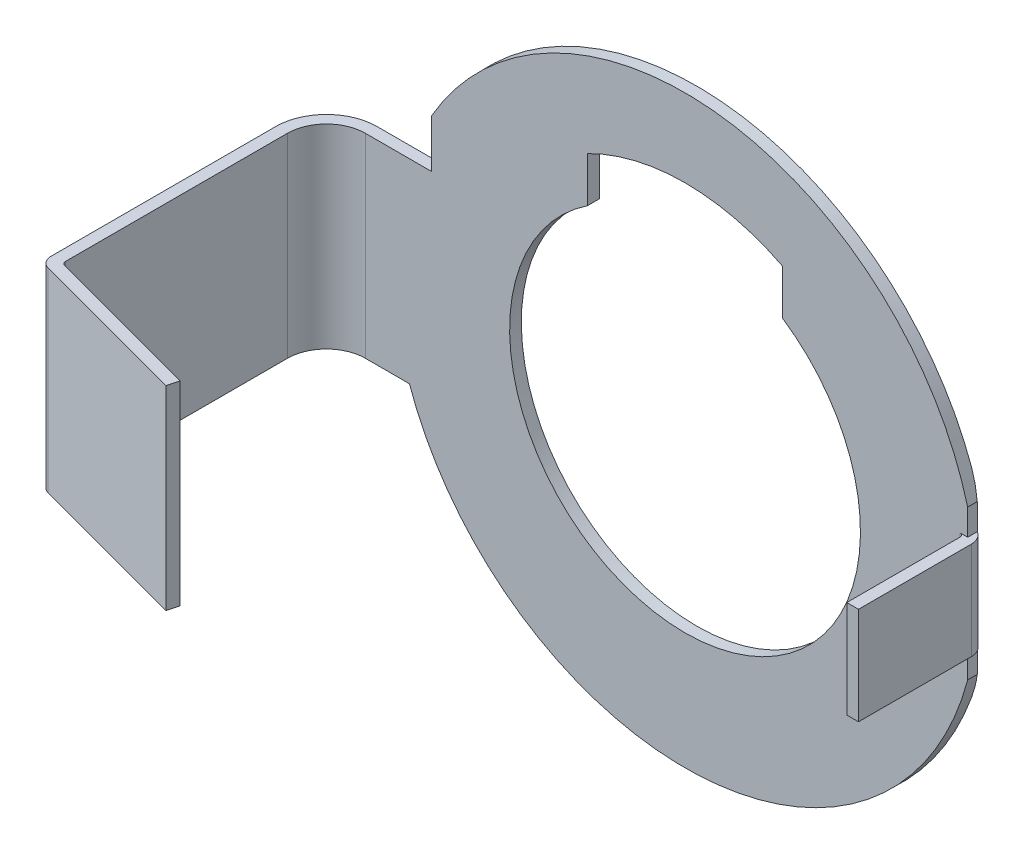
ISO-10303-21;
HEADER;
FILE_DESCRIPTION(('STEP AP214'),'2;1');
FILE_NAME('part.step','',(''),(''),'','','');
FILE_SCHEMA(('AUTOMOTIVE_DESIGN { 1 0 10303 214 1 1 1 1 }'));
ENDSEC;
DATA;
#1=APPLICATION_CONTEXT('core data for automotive mechanical design processes');
#2=APPLICATION_PROTOCOL_DEFINITION('international standard','automotive_design',2000,#1);
#3=PRODUCT_CONTEXT('',#1,'mechanical');
#4=PRODUCT('Part','Part','',(#3));
#5=PRODUCT_RELATED_PRODUCT_CATEGORY('part','',(#4));
#6=PRODUCT_DEFINITION_FORMATION('','',#4);
#7=PRODUCT_DEFINITION_CONTEXT('part definition',#1,'design');
#8=PRODUCT_DEFINITION('design','',#6,#7);
#9=PRODUCT_DEFINITION_SHAPE('','',#8);
#10=(LENGTH_UNIT() NAMED_UNIT(*) SI_UNIT(.MILLI.,.METRE.));
#11=(NAMED_UNIT(*) PLANE_ANGLE_UNIT() SI_UNIT($,.RADIAN.));
#12=(NAMED_UNIT(*) SI_UNIT($,.STERADIAN.) SOLID_ANGLE_UNIT());
#13=UNCERTAINTY_MEASURE_WITH_UNIT(LENGTH_MEASURE(1.E-05),#10,'distance_accuracy_value','');
#14=(GEOMETRIC_REPRESENTATION_CONTEXT(3) GLOBAL_UNCERTAINTY_ASSIGNED_CONTEXT((#13)) GLOBAL_UNIT_ASSIGNED_CONTEXT((#10,
#11,#12)) REPRESENTATION_CONTEXT('',''));
#15=CARTESIAN_POINT('',(0.,0.,0.));
#16=DIRECTION('',(0.,0.,1.));
#17=DIRECTION('',(1.,0.,0.));
#18=AXIS2_PLACEMENT_3D('',#15,#16,#17);
#19=CARTESIAN_POINT('',(7.25,10.,30.0723130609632));
#20=DIRECTION('',(1.,0.,0.));
#21=DIRECTION('',(0.,1.,0.));
#22=AXIS2_PLACEMENT_3D('',#19,#20,#21);
#23=PLANE('',#22);
#24=DIRECTION('',(0.,0.,1.));
#25=VECTOR('',#24,1.);
#26=CARTESIAN_POINT('',(7.25,1.25,30.0723130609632));
#27=LINE('',#26,#25);
#28=CARTESIAN_POINT('',(7.25,1.25,0.0535898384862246));
#29=VERTEX_POINT('',#28);
#30=CARTESIAN_POINT('',(7.25,1.25,0.3));
#31=VERTEX_POINT('',#30);
#32=EDGE_CURVE('E355',#29,#31,#27,.T.);
#33=ORIENTED_EDGE('',*,*,#32,.F.);
#34=DIRECTION('',(0.,1.,0.));
#35=VECTOR('',#34,1.);
#36=CARTESIAN_POINT('',(7.25,1.25,0.0535898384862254));
#37=LINE('',#36,#35);
#38=CARTESIAN_POINT('',(7.25,1.92028643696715,0.053589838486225));
#39=VERTEX_POINT('',#38);
#40=EDGE_CURVE('E362',#29,#39,#37,.T.);
#41=ORIENTED_EDGE('',*,*,#40,.T.);
#42=DIRECTION('',(0.,0.,-1.));
#43=VECTOR('',#42,1.);
#44=CARTESIAN_POINT('',(7.25,1.92028643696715,0.3));
#45=LINE('',#44,#43);
#46=CARTESIAN_POINT('',(7.25,1.92028643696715,0.3));
#47=VERTEX_POINT('',#46);
#48=EDGE_CURVE('E347',#39,#47,#45,.F.);
#49=ORIENTED_EDGE('',*,*,#48,.T.);
#50=DIRECTION('',(0.,1.,0.));
#51=VECTOR('',#50,1.);
#52=CARTESIAN_POINT('',(7.25,0.,0.3));
#53=LINE('',#52,#51);
#54=EDGE_CURVE('E266',#31,#47,#53,.T.);
#55=ORIENTED_EDGE('',*,*,#54,.F.);
#56=EDGE_LOOP('',(#33,#41,#49,#55));
#57=FACE_BOUND('',#56,.T.);
#58=ADVANCED_FACE('F29',(#57),#23,.T.);
#59=CARTESIAN_POINT('',(0.,0.,0.3));
#60=DIRECTION('',(0.,0.,1.));
#61=DIRECTION('',(1.,0.,0.));
#62=AXIS2_PLACEMENT_3D('',#59,#60,#61);
#63=PLANE('',#62);
#64=DIRECTION('',(1.,0.,0.));
#65=VECTOR('',#64,1.);
#66=CARTESIAN_POINT('',(0.,-1.25,0.3));
#67=LINE('',#66,#65);
#68=CARTESIAN_POINT('',(7.05,-1.25,0.3));
#69=VERTEX_POINT('',#68);
#70=CARTESIAN_POINT('',(7.25,-1.25,0.3));
#71=VERTEX_POINT('',#70);
#72=EDGE_CURVE('E261',#69,#71,#67,.T.);
#73=ORIENTED_EDGE('',*,*,#72,.F.);
#74=DIRECTION('',(0.,-1.,0.));
#75=VECTOR('',#74,1.);
#76=CARTESIAN_POINT('',(7.05,1.25,0.3));
#77=LINE('',#76,#75);
#78=CARTESIAN_POINT('',(7.05,1.25,0.3));
#79=VERTEX_POINT('',#78);
#80=EDGE_CURVE('E399',#69,#79,#77,.F.);
#81=ORIENTED_EDGE('',*,*,#80,.T.);
#82=DIRECTION('',(-1.,0.,0.));
#83=VECTOR('',#82,1.);
#84=CARTESIAN_POINT('',(0.,1.25,0.3));
#85=LINE('',#84,#83);
#86=EDGE_CURVE('E264',#31,#79,#85,.T.);
#87=ORIENTED_EDGE('',*,*,#86,.F.);
#88=ORIENTED_EDGE('',*,*,#54,.T.);
#89=CARTESIAN_POINT('',(0.,0.,0.3));
#90=DIRECTION('',(0.,0.,1.));
#91=DIRECTION('',(1.,0.,0.));
#92=AXIS2_PLACEMENT_3D('',#89,#90,#91);
#93=CIRCLE('',#92,7.5);
#94=CARTESIAN_POINT('',(-6.5,3.74165738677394,0.3));
#95=VERTEX_POINT('',#94);
#96=EDGE_CURVE('E322',#47,#95,#93,.T.);
#97=ORIENTED_EDGE('',*,*,#96,.T.);
#98=DIRECTION('',(0.,-1.,0.));
#99=VECTOR('',#98,1.);
#100=CARTESIAN_POINT('',(-6.5,3.74165738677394,0.3));
#101=LINE('',#100,#99);
#102=CARTESIAN_POINT('',(-6.5,2.5,0.3));
#103=VERTEX_POINT('',#102);
#104=EDGE_CURVE('E420',#95,#103,#101,.T.);
#105=ORIENTED_EDGE('',*,*,#104,.T.);
#106=DIRECTION('',(-1.,0.,0.));
#107=VECTOR('',#106,1.);
#108=CARTESIAN_POINT('',(-9.5,2.5,0.3));
#109=LINE('',#108,#107);
#110=CARTESIAN_POINT('',(-8.2,2.5,0.3));
#111=VERTEX_POINT('',#110);
#112=EDGE_CURVE('E415',#103,#111,#109,.T.);
#113=ORIENTED_EDGE('',*,*,#112,.T.);
#114=DIRECTION('',(0.,-1.,0.));
#115=VECTOR('',#114,1.);
#116=CARTESIAN_POINT('',(-8.2,-2.5,0.3));
#117=LINE('',#116,#115);
#118=CARTESIAN_POINT('',(-8.2,-2.5,0.3));
#119=VERTEX_POINT('',#118);
#120=EDGE_CURVE('E325',#111,#119,#117,.T.);
#121=ORIENTED_EDGE('',*,*,#120,.T.);
#122=DIRECTION('',(1.,0.,0.));
#123=VECTOR('',#122,1.);
#124=CARTESIAN_POINT('',(-9.5,-2.5,0.3));
#125=LINE('',#124,#123);
#126=CARTESIAN_POINT('',(-7.07106781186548,-2.5,0.3));
#127=VERTEX_POINT('',#126);
#128=EDGE_CURVE('E314',#119,#127,#125,.T.);
#129=ORIENTED_EDGE('',*,*,#128,.T.);
#130=CARTESIAN_POINT('',(7.25,-1.92028643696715,0.3));
#131=VERTEX_POINT('',#130);
#132=EDGE_CURVE('E317',#127,#131,#93,.T.);
#133=ORIENTED_EDGE('',*,*,#132,.T.);
#134=EDGE_CURVE('E267',#131,#71,#53,.T.);
#135=ORIENTED_EDGE('',*,*,#134,.T.);
#136=EDGE_LOOP('',(#73,#81,#87,#88,#97,#105,#113,#121,#129,#133,#135));
#137=FACE_BOUND('',#136,.T.);
#138=DIRECTION('',(0.,-1.,0.));
#139=VECTOR('',#138,1.);
#140=CARTESIAN_POINT('',(-2.5,4.89897948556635,0.3));
#141=LINE('',#140,#139);
#142=CARTESIAN_POINT('',(-2.5,4.89897948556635,0.3));
#143=VERTEX_POINT('',#142);
#144=CARTESIAN_POINT('',(-2.5,3.74165738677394,0.3));
#145=VERTEX_POINT('',#144);
#146=EDGE_CURVE('E286',#143,#145,#141,.T.);
#147=ORIENTED_EDGE('',*,*,#146,.F.);
#148=CARTESIAN_POINT('',(0.,0.,0.3));
#149=DIRECTION('',(0.,0.,1.));
#150=DIRECTION('',(1.,0.,0.));
#151=AXIS2_PLACEMENT_3D('',#148,#149,#150);
#152=CIRCLE('',#151,5.5);
#153=CARTESIAN_POINT('',(2.5,4.89897948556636,0.3));
#154=VERTEX_POINT('',#153);
#155=EDGE_CURVE('E284',#154,#143,#152,.T.);
#156=ORIENTED_EDGE('',*,*,#155,.F.);
#157=DIRECTION('',(0.,1.,0.));
#158=VECTOR('',#157,1.);
#159=CARTESIAN_POINT('',(2.5,4.89897948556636,0.3));
#160=LINE('',#159,#158);
#161=CARTESIAN_POINT('',(2.5,3.74165738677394,0.3));
#162=VERTEX_POINT('',#161);
#163=EDGE_CURVE('E291',#162,#154,#160,.T.);
#164=ORIENTED_EDGE('',*,*,#163,.F.);
#165=CARTESIAN_POINT('',(0.,0.,0.3));
#166=DIRECTION('',(0.,0.,1.));
#167=DIRECTION('',(1.,0.,0.));
#168=AXIS2_PLACEMENT_3D('',#165,#166,#167);
#169=CIRCLE('',#168,4.5);
#170=EDGE_CURVE('E288',#145,#162,#169,.T.);
#171=ORIENTED_EDGE('',*,*,#170,.F.);
#172=EDGE_LOOP('',(#147,#156,#164,#171));
#173=FACE_BOUND('',#172,.T.);
#174=ADVANCED_FACE('F458',(#137,#173),#63,.T.);
#175=CARTESIAN_POINT('',(0.,0.,0.));
#176=DIRECTION('',(0.,0.,1.));
#177=DIRECTION('',(1.,0.,0.));
#178=AXIS2_PLACEMENT_3D('',#175,#176,#177);
#179=PLANE('',#178);
#180=CARTESIAN_POINT('',(0.,0.,0.));
#181=DIRECTION('',(0.,0.,1.));
#182=DIRECTION('',(1.,0.,0.));
#183=AXIS2_PLACEMENT_3D('',#180,#181,#182);
#184=CIRCLE('',#183,5.5);
#185=CARTESIAN_POINT('',(2.5,4.89897948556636,0.));
#186=VERTEX_POINT('',#185);
#187=CARTESIAN_POINT('',(-2.5,4.89897948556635,0.));
#188=VERTEX_POINT('',#187);
#189=EDGE_CURVE('E271',#186,#188,#184,.T.);
#190=ORIENTED_EDGE('',*,*,#189,.T.);
#191=DIRECTION('',(0.,-1.,0.));
#192=VECTOR('',#191,1.);
#193=CARTESIAN_POINT('',(-2.5,4.89897948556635,0.));
#194=LINE('',#193,#192);
#195=CARTESIAN_POINT('',(-2.5,3.74165738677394,0.));
#196=VERTEX_POINT('',#195);
#197=EDGE_CURVE('E274',#188,#196,#194,.T.);
#198=ORIENTED_EDGE('',*,*,#197,.T.);
#199=CARTESIAN_POINT('',(0.,0.,0.));
#200=DIRECTION('',(0.,0.,1.));
#201=DIRECTION('',(1.,0.,0.));
#202=AXIS2_PLACEMENT_3D('',#199,#200,#201);
#203=CIRCLE('',#202,4.5);
#204=CARTESIAN_POINT('',(2.5,3.74165738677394,0.));
#205=VERTEX_POINT('',#204);
#206=EDGE_CURVE('E278',#196,#205,#203,.T.);
#207=ORIENTED_EDGE('',*,*,#206,.T.);
#208=DIRECTION('',(0.,1.,0.));
#209=VECTOR('',#208,1.);
#210=CARTESIAN_POINT('',(2.5,4.89897948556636,0.));
#211=LINE('',#210,#209);
#212=EDGE_CURVE('E281',#205,#186,#211,.T.);
#213=ORIENTED_EDGE('',*,*,#212,.T.);
#214=EDGE_LOOP('',(#190,#198,#207,#213));
#215=FACE_BOUND('',#214,.T.);
#216=CARTESIAN_POINT('',(0.,0.,0.));
#217=DIRECTION('',(0.,0.,1.));
#218=DIRECTION('',(1.,0.,0.));
#219=AXIS2_PLACEMENT_3D('',#216,#217,#218);
#220=CIRCLE('',#219,7.5);
#221=CARTESIAN_POINT('',(7.05,2.5588083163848,0.));
#222=VERTEX_POINT('',#221);
#223=CARTESIAN_POINT('',(-6.5,3.74165738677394,0.));
#224=VERTEX_POINT('',#223);
#225=EDGE_CURVE('E305',#222,#224,#220,.T.);
#226=ORIENTED_EDGE('',*,*,#225,.F.);
#227=DIRECTION('',(0.,1.,0.));
#228=VECTOR('',#227,1.);
#229=CARTESIAN_POINT('',(7.05,0.,0.));
#230=LINE('',#229,#228);
#231=CARTESIAN_POINT('',(7.05,-2.5588083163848,0.));
#232=VERTEX_POINT('',#231);
#233=EDGE_CURVE('E371',#222,#232,#230,.F.);
#234=ORIENTED_EDGE('',*,*,#233,.T.);
#235=CARTESIAN_POINT('',(-7.07106781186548,-2.5,0.));
#236=VERTEX_POINT('',#235);
#237=EDGE_CURVE('E306',#236,#232,#220,.T.);
#238=ORIENTED_EDGE('',*,*,#237,.F.);
#239=DIRECTION('',(1.,0.,0.));
#240=VECTOR('',#239,1.);
#241=CARTESIAN_POINT('',(-9.5,-2.5,0.));
#242=LINE('',#241,#240);
#243=CARTESIAN_POINT('',(-8.2,-2.5,0.));
#244=VERTEX_POINT('',#243);
#245=EDGE_CURVE('E303',#244,#236,#242,.T.);
#246=ORIENTED_EDGE('',*,*,#245,.F.);
#247=DIRECTION('',(0.,-1.,0.));
#248=VECTOR('',#247,1.);
#249=CARTESIAN_POINT('',(-8.2,0.,0.));
#250=LINE('',#249,#248);
#251=CARTESIAN_POINT('',(-8.2,2.5,0.));
#252=VERTEX_POINT('',#251);
#253=EDGE_CURVE('E342',#244,#252,#250,.F.);
#254=ORIENTED_EDGE('',*,*,#253,.T.);
#255=DIRECTION('',(-1.,0.,0.));
#256=VECTOR('',#255,1.);
#257=CARTESIAN_POINT('',(-9.5,2.5,0.));
#258=LINE('',#257,#256);
#259=CARTESIAN_POINT('',(-6.5,2.5,0.));
#260=VERTEX_POINT('',#259);
#261=EDGE_CURVE('E311',#260,#252,#258,.T.);
#262=ORIENTED_EDGE('',*,*,#261,.F.);
#263=DIRECTION('',(0.,-1.,0.));
#264=VECTOR('',#263,1.);
#265=CARTESIAN_POINT('',(-6.5,3.74165738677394,0.));
#266=LINE('',#265,#264);
#267=EDGE_CURVE('E309',#224,#260,#266,.T.);
#268=ORIENTED_EDGE('',*,*,#267,.F.);
#269=EDGE_LOOP('',(#226,#234,#238,#246,#254,#262,#268));
#270=FACE_BOUND('',#269,.T.);
#271=ADVANCED_FACE('F382',(#215,#270),#179,.F.);
#272=CARTESIAN_POINT('',(0.,0.,0.3));
#273=DIRECTION('',(0.,0.,-1.));
#274=DIRECTION('',(-1.,0.,0.));
#275=AXIS2_PLACEMENT_3D('',#272,#273,#274);
#276=CYLINDRICAL_SURFACE('',#275,7.5);
#277=ORIENTED_EDGE('',*,*,#237,.T.);
#278=CARTESIAN_POINT('',(7.05,-2.5588083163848,0.));
#279=CARTESIAN_POINT('',(7.06913024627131,-2.50610443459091,2.0071498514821E-05));
#280=CARTESIAN_POINT('',(7.08766163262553,-2.45320068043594,0.00137069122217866));
#281=CARTESIAN_POINT('',(7.1234716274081,-2.34718383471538,0.00638604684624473));
#282=CARTESIAN_POINT('',(7.14075243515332,-2.29407129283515,0.0100466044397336));
#283=CARTESIAN_POINT('',(7.17407392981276,-2.18764111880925,0.0193369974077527));
#284=CARTESIAN_POINT('',(7.19011472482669,-2.13432350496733,0.0249666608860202));
#285=CARTESIAN_POINT('',(7.22098066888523,-2.0274464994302,0.0379989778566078));
#286=CARTESIAN_POINT('',(7.23580357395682,-1.9738868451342,0.0454048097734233));
#287=CARTESIAN_POINT('',(7.25,-1.92028643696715,0.053589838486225));
#288=B_SPLINE_CURVE_WITH_KNOTS('',3,(#278,#279,#280,#281,#282,#283,#284,#285,#286,#287),
.UNSPECIFIED.,.F.,.F.,(4,2,2,2,4),(0.,0.168162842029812,0.336022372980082,0.503867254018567,
0.672014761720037),.UNSPECIFIED.);
#289=CARTESIAN_POINT('',(7.25,-1.92028643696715,0.053589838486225));
#290=VERTEX_POINT('',#289);
#291=EDGE_CURVE('E387',#232,#290,#288,.T.);
#292=ORIENTED_EDGE('',*,*,#291,.T.);
#293=DIRECTION('',(0.,0.,-1.));
#294=VECTOR('',#293,1.);
#295=CARTESIAN_POINT('',(7.25,-1.92028643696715,0.3));
#296=LINE('',#295,#294);
#297=EDGE_CURVE('E349',#131,#290,#296,.T.);
#298=ORIENTED_EDGE('',*,*,#297,.F.);
#299=ORIENTED_EDGE('',*,*,#132,.F.);
#300=DIRECTION('',(0.,0.,-1.));
#301=VECTOR('',#300,1.);
#302=CARTESIAN_POINT('',(-7.07106781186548,-2.5,0.3));
#303=LINE('',#302,#301);
#304=EDGE_CURVE('E430',#127,#236,#303,.T.);
#305=ORIENTED_EDGE('',*,*,#304,.T.);
#306=EDGE_LOOP('',(#277,#292,#298,#299,#305));
#307=FACE_BOUND('',#306,.T.);
#308=ADVANCED_FACE('F377',(#307),#276,.T.);
#309=ORIENTED_EDGE('',*,*,#48,.F.);
#310=CARTESIAN_POINT('',(7.25,1.92028643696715,0.053589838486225));
#311=CARTESIAN_POINT('',(7.23580357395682,1.9738868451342,0.045404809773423));
#312=CARTESIAN_POINT('',(7.22098066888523,2.0274464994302,0.0379989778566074));
#313=CARTESIAN_POINT('',(7.19011472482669,2.13432350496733,0.02496666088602));
#314=CARTESIAN_POINT('',(7.17407392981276,2.18764111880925,0.0193369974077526));
#315=CARTESIAN_POINT('',(7.14075243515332,2.29407129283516,0.0100466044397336));
#316=CARTESIAN_POINT('',(7.1234716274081,2.34718383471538,0.00638604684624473));
#317=CARTESIAN_POINT('',(7.08766163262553,2.45320068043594,0.00137069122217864));
#318=CARTESIAN_POINT('',(7.06913024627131,2.50610443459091,2.00714985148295E-05));
#319=CARTESIAN_POINT('',(7.05,2.5588083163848,0.));
#320=B_SPLINE_CURVE_WITH_KNOTS('',3,(#310,#311,#312,#313,#314,#315,#316,#317,#318,#319),
.UNSPECIFIED.,.F.,.F.,(4,2,2,2,4),(0.,0.16814750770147,0.335992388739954,0.503851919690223,
0.672014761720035),.UNSPECIFIED.);
#321=EDGE_CURVE('E364',#39,#222,#320,.T.);
#322=ORIENTED_EDGE('',*,*,#321,.T.);
#323=ORIENTED_EDGE('',*,*,#225,.T.);
#324=DIRECTION('',(0.,0.,-1.));
#325=VECTOR('',#324,1.);
#326=CARTESIAN_POINT('',(-6.5,3.74165738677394,0.3));
#327=LINE('',#326,#325);
#328=EDGE_CURVE('E428',#95,#224,#327,.T.);
#329=ORIENTED_EDGE('',*,*,#328,.F.);
#330=ORIENTED_EDGE('',*,*,#96,.F.);
#331=EDGE_LOOP('',(#309,#322,#323,#329,#330));
#332=FACE_BOUND('',#331,.T.);
#333=ADVANCED_FACE('F381',(#332),#276,.T.);
#334=CARTESIAN_POINT('',(-9.5,2.5,0.3));
#335=DIRECTION('',(1.,0.,0.));
#336=DIRECTION('',(0.,0.,-1.));
#337=AXIS2_PLACEMENT_3D('',#334,#335,#336);
#338=PLANE('',#337);
#339=DIRECTION('',(0.,0.,-1.));
#340=VECTOR('',#339,1.);
#341=CARTESIAN_POINT('',(-9.5,-2.5,0.3));
#342=LINE('',#341,#340);
#343=CARTESIAN_POINT('',(-9.5,-2.5,7.06980190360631));
#344=VERTEX_POINT('',#343);
#345=CARTESIAN_POINT('',(-9.5,-2.5,1.3));
#346=VERTEX_POINT('',#345);
#347=EDGE_CURVE('E329',#344,#346,#342,.T.);
#348=ORIENTED_EDGE('',*,*,#347,.F.);
#349=DIRECTION('',(0.,-1.,0.));
#350=VECTOR('',#349,1.);
#351=CARTESIAN_POINT('',(-9.5,2.5,7.06980190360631));
#352=LINE('',#351,#350);
#353=CARTESIAN_POINT('',(-9.5,2.5,7.06980190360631));
#354=VERTEX_POINT('',#353);
#355=EDGE_CURVE('E37',#344,#354,#352,.F.);
#356=ORIENTED_EDGE('',*,*,#355,.T.);
#357=DIRECTION('',(0.,0.,-1.));
#358=VECTOR('',#357,1.);
#359=CARTESIAN_POINT('',(-9.5,2.5,0.3));
#360=LINE('',#359,#358);
#361=CARTESIAN_POINT('',(-9.5,2.5,1.3));
#362=VERTEX_POINT('',#361);
#363=EDGE_CURVE('E419',#354,#362,#360,.T.);
#364=ORIENTED_EDGE('',*,*,#363,.T.);
#365=DIRECTION('',(0.,-1.,0.));
#366=VECTOR('',#365,1.);
#367=CARTESIAN_POINT('',(-9.5,2.5,1.3));
#368=LINE('',#367,#366);
#369=EDGE_CURVE('E337',#362,#346,#368,.T.);
#370=ORIENTED_EDGE('',*,*,#369,.T.);
#371=EDGE_LOOP('',(#348,#356,#364,#370));
#372=FACE_BOUND('',#371,.T.);
#373=ADVANCED_FACE('F31',(#372),#338,.F.);
#374=CARTESIAN_POINT('',(-9.5,-2.5,0.3));
#375=DIRECTION('',(0.,1.,0.));
#376=DIRECTION('',(-1.,0.,0.));
#377=AXIS2_PLACEMENT_3D('',#374,#375,#376);
#378=PLANE('',#377);
#379=DIRECTION('',(0.965925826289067,0.,0.258819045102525));
#380=VECTOR('',#379,1.);
#381=CARTESIAN_POINT('',(-9.5,-2.5,7.3));
#382=LINE('',#381,#380);
#383=CARTESIAN_POINT('',(-9.27764571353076,-2.5,7.35957965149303));
#384=VERTEX_POINT('',#383);
#385=CARTESIAN_POINT('',(-5.1533337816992,-2.5,8.46468570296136));
#386=VERTEX_POINT('',#385);
#387=EDGE_CURVE('E206',#384,#386,#382,.T.);
#388=ORIENTED_EDGE('',*,*,#387,.F.);
#389=CARTESIAN_POINT('',(-9.2,-2.5,7.06980190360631));
#390=DIRECTION('',(0.,1.,0.));
#391=DIRECTION('',(-1.,0.,0.));
#392=AXIS2_PLACEMENT_3D('',#389,#390,#391);
#393=CIRCLE('',#392,0.3);
#394=EDGE_CURVE('E51',#384,#344,#393,.F.);
#395=ORIENTED_EDGE('',*,*,#394,.T.);
#396=ORIENTED_EDGE('',*,*,#347,.T.);
#397=CARTESIAN_POINT('',(-8.2,-2.5,1.3));
#398=DIRECTION('',(0.,1.,0.));
#399=DIRECTION('',(-1.,0.,0.));
#400=AXIS2_PLACEMENT_3D('',#397,#398,#399);
#401=CIRCLE('',#400,1.3);
#402=EDGE_CURVE('E340',#346,#244,#401,.F.);
#403=ORIENTED_EDGE('',*,*,#402,.T.);
#404=ORIENTED_EDGE('',*,*,#245,.T.);
#405=ORIENTED_EDGE('',*,*,#304,.F.);
#406=ORIENTED_EDGE('',*,*,#128,.F.);
#407=CARTESIAN_POINT('',(-8.2,-2.5,1.3));
#408=DIRECTION('',(0.,1.,0.));
#409=DIRECTION('',(-1.,0.,0.));
#410=AXIS2_PLACEMENT_3D('',#407,#408,#409);
#411=CIRCLE('',#410,1.);
#412=CARTESIAN_POINT('',(-9.2,-2.5,1.3));
#413=VERTEX_POINT('',#412);
#414=EDGE_CURVE('E332',#119,#413,#411,.T.);
#415=ORIENTED_EDGE('',*,*,#414,.T.);
#416=DIRECTION('',(0.,0.,-1.));
#417=VECTOR('',#416,1.);
#418=CARTESIAN_POINT('',(-9.2,-2.5,7.3));
#419=LINE('',#418,#417);
#420=CARTESIAN_POINT('',(-9.2,-2.5,6.99306920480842));
#421=VERTEX_POINT('',#420);
#422=EDGE_CURVE('E275',#421,#413,#419,.T.);
#423=ORIENTED_EDGE('',*,*,#422,.F.);
#424=CARTESIAN_POINT('',(-9.1,-2.5,6.99306920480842));
#425=DIRECTION('',(0.,1.,0.));
#426=DIRECTION('',(-1.,0.,0.));
#427=AXIS2_PLACEMENT_3D('',#424,#425,#426);
#428=CIRCLE('',#427,0.1);
#429=CARTESIAN_POINT('',(-9.12588190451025,-2.5,7.08966178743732));
#430=VERTEX_POINT('',#429);
#431=EDGE_CURVE('E473',#421,#430,#428,.T.);
#432=ORIENTED_EDGE('',*,*,#431,.T.);
#433=DIRECTION('',(0.965925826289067,0.,0.258819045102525));
#434=VECTOR('',#433,1.);
#435=CARTESIAN_POINT('',(-9.42235428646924,-2.5,7.01022225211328));
#436=LINE('',#435,#434);
#437=CARTESIAN_POINT('',(-5.07568806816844,-2.5,8.17490795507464));
#438=VERTEX_POINT('',#437);
#439=EDGE_CURVE('E228',#430,#438,#436,.T.);
#440=ORIENTED_EDGE('',*,*,#439,.T.);
#441=DIRECTION('',(-0.258819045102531,0.,0.965925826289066));
#442=VECTOR('',#441,1.);
#443=CARTESIAN_POINT('',(-5.07568806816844,-2.5,8.17490795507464));
#444=LINE('',#443,#442);
#445=EDGE_CURVE('E215',#438,#386,#444,.T.);
#446=ORIENTED_EDGE('',*,*,#445,.T.);
#447=EDGE_LOOP('',(#388,#395,#396,#403,#404,#405,#406,#415,#423,#432,#440,#446));
#448=FACE_BOUND('',#447,.T.);
#449=ADVANCED_FACE('F226',(#448),#378,.F.);
#450=CARTESIAN_POINT('',(-6.5,3.74165738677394,0.3));
#451=DIRECTION('',(1.,0.,0.));
#452=DIRECTION('',(0.,1.,0.));
#453=AXIS2_PLACEMENT_3D('',#450,#451,#452);
#454=PLANE('',#453);
#455=ORIENTED_EDGE('',*,*,#267,.T.);
#456=DIRECTION('',(0.,0.,-1.));
#457=VECTOR('',#456,1.);
#458=CARTESIAN_POINT('',(-6.5,2.5,0.3));
#459=LINE('',#458,#457);
#460=EDGE_CURVE('E425',#103,#260,#459,.T.);
#461=ORIENTED_EDGE('',*,*,#460,.F.);
#462=ORIENTED_EDGE('',*,*,#104,.F.);
#463=ORIENTED_EDGE('',*,*,#328,.T.);
#464=EDGE_LOOP('',(#455,#461,#462,#463));
#465=FACE_BOUND('',#464,.T.);
#466=ADVANCED_FACE('F384',(#465),#454,.F.);
#467=CARTESIAN_POINT('',(-9.5,2.5,0.3));
#468=DIRECTION('',(0.,-1.,0.));
#469=DIRECTION('',(1.,0.,0.));
#470=AXIS2_PLACEMENT_3D('',#467,#468,#469);
#471=PLANE('',#470);
#472=ORIENTED_EDGE('',*,*,#363,.F.);
#473=CARTESIAN_POINT('',(-9.2,2.5,7.06980190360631));
#474=DIRECTION('',(0.,-1.,0.));
#475=DIRECTION('',(1.,0.,0.));
#476=AXIS2_PLACEMENT_3D('',#473,#474,#475);
#477=CIRCLE('',#476,0.3);
#478=CARTESIAN_POINT('',(-9.27764571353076,2.5,7.35957965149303));
#479=VERTEX_POINT('',#478);
#480=EDGE_CURVE('E11',#354,#479,#477,.F.);
#481=ORIENTED_EDGE('',*,*,#480,.T.);
#482=DIRECTION('',(0.965925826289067,0.,0.258819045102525));
#483=VECTOR('',#482,1.);
#484=CARTESIAN_POINT('',(-9.5,2.5,7.3));
#485=LINE('',#484,#483);
#486=CARTESIAN_POINT('',(-5.1533337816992,2.5,8.46468570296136));
#487=VERTEX_POINT('',#486);
#488=EDGE_CURVE('E231',#479,#487,#485,.T.);
#489=ORIENTED_EDGE('',*,*,#488,.T.);
#490=DIRECTION('',(-0.258819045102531,0.,0.965925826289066));
#491=VECTOR('',#490,1.);
#492=CARTESIAN_POINT('',(-5.07568806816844,2.5,8.17490795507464));
#493=LINE('',#492,#491);
#494=CARTESIAN_POINT('',(-5.07568806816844,2.5,8.17490795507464));
#495=VERTEX_POINT('',#494);
#496=EDGE_CURVE('E222',#495,#487,#493,.T.);
#497=ORIENTED_EDGE('',*,*,#496,.F.);
#498=DIRECTION('',(0.965925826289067,0.,0.258819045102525));
#499=VECTOR('',#498,1.);
#500=CARTESIAN_POINT('',(-9.42235428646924,2.5,7.01022225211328));
#501=LINE('',#500,#499);
#502=CARTESIAN_POINT('',(-9.12588190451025,2.5,7.08966178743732));
#503=VERTEX_POINT('',#502);
#504=EDGE_CURVE('E236',#503,#495,#501,.T.);
#505=ORIENTED_EDGE('',*,*,#504,.F.);
#506=CARTESIAN_POINT('',(-9.1,2.5,6.99306920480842));
#507=DIRECTION('',(0.,-1.,0.));
#508=DIRECTION('',(1.,0.,0.));
#509=AXIS2_PLACEMENT_3D('',#506,#507,#508);
#510=CIRCLE('',#509,0.1);
#511=CARTESIAN_POINT('',(-9.2,2.5,6.99306920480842));
#512=VERTEX_POINT('',#511);
#513=EDGE_CURVE('E479',#503,#512,#510,.T.);
#514=ORIENTED_EDGE('',*,*,#513,.T.);
#515=DIRECTION('',(0.,0.,-1.));
#516=VECTOR('',#515,1.);
#517=CARTESIAN_POINT('',(-9.2,2.5,7.3));
#518=LINE('',#517,#516);
#519=CARTESIAN_POINT('',(-9.2,2.5,1.3));
#520=VERTEX_POINT('',#519);
#521=EDGE_CURVE('E270',#512,#520,#518,.T.);
#522=ORIENTED_EDGE('',*,*,#521,.T.);
#523=CARTESIAN_POINT('',(-8.2,2.5,1.3));
#524=DIRECTION('',(0.,-1.,0.));
#525=DIRECTION('',(1.,0.,0.));
#526=AXIS2_PLACEMENT_3D('',#523,#524,#525);
#527=CIRCLE('',#526,1.);
#528=EDGE_CURVE('E335',#520,#111,#527,.T.);
#529=ORIENTED_EDGE('',*,*,#528,.T.);
#530=ORIENTED_EDGE('',*,*,#112,.F.);
#531=ORIENTED_EDGE('',*,*,#460,.T.);
#532=ORIENTED_EDGE('',*,*,#261,.T.);
#533=CARTESIAN_POINT('',(-8.2,2.5,1.3));
#534=DIRECTION('',(0.,-1.,0.));
#535=DIRECTION('',(1.,0.,0.));
#536=AXIS2_PLACEMENT_3D('',#533,#534,#535);
#537=CIRCLE('',#536,1.3);
#538=EDGE_CURVE('E344',#252,#362,#537,.F.);
#539=ORIENTED_EDGE('',*,*,#538,.T.);
#540=EDGE_LOOP('',(#472,#481,#489,#497,#505,#514,#522,#529,#530,#531,#532,#539));
#541=FACE_BOUND('',#540,.T.);
#542=ADVANCED_FACE('F444',(#541),#471,.F.);
#543=CARTESIAN_POINT('',(0.,0.,0.3));
#544=DIRECTION('',(0.,0.,-1.));
#545=DIRECTION('',(-1.,0.,0.));
#546=AXIS2_PLACEMENT_3D('',#543,#544,#545);
#547=CYLINDRICAL_SURFACE('',#546,5.5);
#548=ORIENTED_EDGE('',*,*,#189,.F.);
#549=DIRECTION('',(0.,0.,-1.));
#550=VECTOR('',#549,1.);
#551=CARTESIAN_POINT('',(2.5,4.89897948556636,0.3));
#552=LINE('',#551,#550);
#553=EDGE_CURVE('E293',#154,#186,#552,.T.);
#554=ORIENTED_EDGE('',*,*,#553,.F.);
#555=ORIENTED_EDGE('',*,*,#155,.T.);
#556=DIRECTION('',(0.,0.,-1.));
#557=VECTOR('',#556,1.);
#558=CARTESIAN_POINT('',(-2.5,4.89897948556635,0.3));
#559=LINE('',#558,#557);
#560=EDGE_CURVE('E300',#143,#188,#559,.T.);
#561=ORIENTED_EDGE('',*,*,#560,.T.);
#562=EDGE_LOOP('',(#548,#554,#555,#561));
#563=FACE_BOUND('',#562,.T.);
#564=ADVANCED_FACE('F599',(#563),#547,.F.);
#565=CARTESIAN_POINT('',(-2.5,4.89897948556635,0.3));
#566=DIRECTION('',(1.,0.,0.));
#567=DIRECTION('',(0.,1.,0.));
#568=AXIS2_PLACEMENT_3D('',#565,#566,#567);
#569=PLANE('',#568);
#570=ORIENTED_EDGE('',*,*,#197,.F.);
#571=ORIENTED_EDGE('',*,*,#560,.F.);
#572=ORIENTED_EDGE('',*,*,#146,.T.);
#573=DIRECTION('',(0.,0.,-1.));
#574=VECTOR('',#573,1.);
#575=CARTESIAN_POINT('',(-2.5,3.74165738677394,0.3));
#576=LINE('',#575,#574);
#577=EDGE_CURVE('E298',#145,#196,#576,.T.);
#578=ORIENTED_EDGE('',*,*,#577,.T.);
#579=EDGE_LOOP('',(#570,#571,#572,#578));
#580=FACE_BOUND('',#579,.T.);
#581=ADVANCED_FACE('F634',(#580),#569,.T.);
#582=CARTESIAN_POINT('',(0.,0.,0.3));
#583=DIRECTION('',(0.,0.,-1.));
#584=DIRECTION('',(-1.,0.,0.));
#585=AXIS2_PLACEMENT_3D('',#582,#583,#584);
#586=CYLINDRICAL_SURFACE('',#585,4.5);
#587=ORIENTED_EDGE('',*,*,#206,.F.);
#588=ORIENTED_EDGE('',*,*,#577,.F.);
#589=ORIENTED_EDGE('',*,*,#170,.T.);
#590=DIRECTION('',(0.,0.,-1.));
#591=VECTOR('',#590,1.);
#592=CARTESIAN_POINT('',(2.5,3.74165738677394,0.3));
#593=LINE('',#592,#591);
#594=EDGE_CURVE('E296',#162,#205,#593,.T.);
#595=ORIENTED_EDGE('',*,*,#594,.T.);
#596=EDGE_LOOP('',(#587,#588,#589,#595));
#597=FACE_BOUND('',#596,.T.);
#598=ADVANCED_FACE('F627',(#597),#586,.F.);
#599=CARTESIAN_POINT('',(2.5,4.89897948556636,0.3));
#600=DIRECTION('',(-1.,0.,0.));
#601=DIRECTION('',(0.,-1.,0.));
#602=AXIS2_PLACEMENT_3D('',#599,#600,#601);
#603=PLANE('',#602);
#604=ORIENTED_EDGE('',*,*,#212,.F.);
#605=ORIENTED_EDGE('',*,*,#594,.F.);
#606=ORIENTED_EDGE('',*,*,#163,.T.);
#607=ORIENTED_EDGE('',*,*,#553,.T.);
#608=EDGE_LOOP('',(#604,#605,#606,#607));
#609=FACE_BOUND('',#608,.T.);
#610=ADVANCED_FACE('F633',(#609),#603,.T.);
#611=CARTESIAN_POINT('',(-9.2,2.5,7.3));
#612=DIRECTION('',(1.,0.,0.));
#613=DIRECTION('',(0.,0.,-1.));
#614=AXIS2_PLACEMENT_3D('',#611,#612,#613);
#615=PLANE('',#614);
#616=ORIENTED_EDGE('',*,*,#521,.F.);
#617=DIRECTION('',(0.,1.,0.));
#618=VECTOR('',#617,1.);
#619=CARTESIAN_POINT('',(-9.2,-2.5,6.99306920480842));
#620=LINE('',#619,#618);
#621=EDGE_CURVE('E410',#512,#421,#620,.F.);
#622=ORIENTED_EDGE('',*,*,#621,.T.);
#623=ORIENTED_EDGE('',*,*,#422,.T.);
#624=DIRECTION('',(0.,-1.,0.));
#625=VECTOR('',#624,1.);
#626=CARTESIAN_POINT('',(-9.2,2.5,1.3));
#627=LINE('',#626,#625);
#628=EDGE_CURVE('E328',#413,#520,#627,.F.);
#629=ORIENTED_EDGE('',*,*,#628,.T.);
#630=EDGE_LOOP('',(#616,#622,#623,#629));
#631=FACE_BOUND('',#630,.T.);
#632=ADVANCED_FACE('F485',(#631),#615,.T.);
#633=CARTESIAN_POINT('',(-8.2,0.,1.3));
#634=DIRECTION('',(0.,1.,0.));
#635=DIRECTION('',(0.,0.,1.));
#636=AXIS2_PLACEMENT_3D('',#633,#634,#635);
#637=CYLINDRICAL_SURFACE('',#636,1.);
#638=ORIENTED_EDGE('',*,*,#528,.F.);
#639=ORIENTED_EDGE('',*,*,#628,.F.);
#640=ORIENTED_EDGE('',*,*,#414,.F.);
#641=ORIENTED_EDGE('',*,*,#120,.F.);
#642=EDGE_LOOP('',(#638,#639,#640,#641));
#643=FACE_BOUND('',#642,.T.);
#644=ADVANCED_FACE('F469',(#643),#637,.F.);
#645=CARTESIAN_POINT('',(-8.2,2.5,1.3));
#646=DIRECTION('',(0.,-1.,0.));
#647=DIRECTION('',(0.,0.,-1.));
#648=AXIS2_PLACEMENT_3D('',#645,#646,#647);
#649=CYLINDRICAL_SURFACE('',#648,1.3);
#650=ORIENTED_EDGE('',*,*,#538,.F.);
#651=ORIENTED_EDGE('',*,*,#253,.F.);
#652=ORIENTED_EDGE('',*,*,#402,.F.);
#653=ORIENTED_EDGE('',*,*,#369,.F.);
#654=EDGE_LOOP('',(#650,#651,#652,#653));
#655=FACE_BOUND('',#654,.T.);
#656=ADVANCED_FACE('F441',(#655),#649,.T.);
#657=ORIENTED_EDGE('',*,*,#297,.T.);
#658=DIRECTION('',(0.,1.,0.));
#659=VECTOR('',#658,1.);
#660=CARTESIAN_POINT('',(7.25,-1.92028643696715,0.053589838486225));
#661=LINE('',#660,#659);
#662=CARTESIAN_POINT('',(7.25,-1.25,0.0535898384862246));
#663=VERTEX_POINT('',#662);
#664=EDGE_CURVE('E392',#290,#663,#661,.T.);
#665=ORIENTED_EDGE('',*,*,#664,.T.);
#666=DIRECTION('',(0.,0.,-1.));
#667=VECTOR('',#666,1.);
#668=CARTESIAN_POINT('',(7.25,-1.25,30.0723130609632));
#669=LINE('',#668,#667);
#670=EDGE_CURVE('E352',#71,#663,#669,.T.);
#671=ORIENTED_EDGE('',*,*,#670,.F.);
#672=ORIENTED_EDGE('',*,*,#134,.F.);
#673=EDGE_LOOP('',(#657,#665,#671,#672));
#674=FACE_BOUND('',#673,.T.);
#675=ADVANCED_FACE('F500',(#674),#23,.T.);
#676=CARTESIAN_POINT('',(7.45,-1.25,3.3));
#677=DIRECTION('',(-1.,0.,0.));
#678=DIRECTION('',(0.,0.,1.));
#679=AXIS2_PLACEMENT_3D('',#676,#677,#678);
#680=PLANE('',#679);
#681=DIRECTION('',(0.,0.,-1.));
#682=VECTOR('',#681,1.);
#683=CARTESIAN_POINT('',(7.45,-1.25,3.3));
#684=LINE('',#683,#682);
#685=CARTESIAN_POINT('',(7.45,-1.25,3.3));
#686=VERTEX_POINT('',#685);
#687=CARTESIAN_POINT('',(7.45,-1.25,0.4));
#688=VERTEX_POINT('',#687);
#689=EDGE_CURVE('E249',#686,#688,#684,.T.);
#690=ORIENTED_EDGE('',*,*,#689,.T.);
#691=DIRECTION('',(0.,1.,0.));
#692=VECTOR('',#691,1.);
#693=CARTESIAN_POINT('',(7.45,-1.25,0.4));
#694=LINE('',#693,#692);
#695=CARTESIAN_POINT('',(7.45,1.25,0.4));
#696=VERTEX_POINT('',#695);
#697=EDGE_CURVE('E357',#688,#696,#694,.T.);
#698=ORIENTED_EDGE('',*,*,#697,.T.);
#699=DIRECTION('',(0.,0.,-1.));
#700=VECTOR('',#699,1.);
#701=CARTESIAN_POINT('',(7.45,1.25,3.3));
#702=LINE('',#701,#700);
#703=CARTESIAN_POINT('',(7.45,1.25,3.3));
#704=VERTEX_POINT('',#703);
#705=EDGE_CURVE('E258',#704,#696,#702,.T.);
#706=ORIENTED_EDGE('',*,*,#705,.F.);
#707=DIRECTION('',(0.,1.,0.));
#708=VECTOR('',#707,1.);
#709=CARTESIAN_POINT('',(7.45,-1.25,3.3));
#710=LINE('',#709,#708);
#711=EDGE_CURVE('E223',#686,#704,#710,.T.);
#712=ORIENTED_EDGE('',*,*,#711,.F.);
#713=EDGE_LOOP('',(#690,#698,#706,#712));
#714=FACE_BOUND('',#713,.T.);
#715=ADVANCED_FACE('F509',(#714),#680,.F.);
#716=CARTESIAN_POINT('',(7.15,1.25,3.3));
#717=DIRECTION('',(0.,1.,0.));
#718=DIRECTION('',(0.,0.,1.));
#719=AXIS2_PLACEMENT_3D('',#716,#717,#718);
#720=PLANE('',#719);
#721=ORIENTED_EDGE('',*,*,#705,.T.);
#722=CARTESIAN_POINT('',(7.05,1.25,0.4));
#723=DIRECTION('',(0.,1.,0.));
#724=DIRECTION('',(0.,0.,1.));
#725=AXIS2_PLACEMENT_3D('',#722,#723,#724);
#726=CIRCLE('',#725,0.4);
#727=EDGE_CURVE('E360',#696,#29,#726,.T.);
#728=ORIENTED_EDGE('',*,*,#727,.T.);
#729=ORIENTED_EDGE('',*,*,#32,.T.);
#730=ORIENTED_EDGE('',*,*,#86,.T.);
#731=CARTESIAN_POINT('',(7.05,1.25,0.4));
#732=DIRECTION('',(0.,1.,0.));
#733=DIRECTION('',(0.,0.,1.));
#734=AXIS2_PLACEMENT_3D('',#731,#732,#733);
#735=CIRCLE('',#734,0.1);
#736=CARTESIAN_POINT('',(7.15,1.25,0.4));
#737=VERTEX_POINT('',#736);
#738=EDGE_CURVE('E405',#79,#737,#735,.F.);
#739=ORIENTED_EDGE('',*,*,#738,.T.);
#740=DIRECTION('',(0.,0.,-1.));
#741=VECTOR('',#740,1.);
#742=CARTESIAN_POINT('',(7.15,1.25,3.3));
#743=LINE('',#742,#741);
#744=CARTESIAN_POINT('',(7.15,1.25,3.3));
#745=VERTEX_POINT('',#744);
#746=EDGE_CURVE('E255',#745,#737,#743,.T.);
#747=ORIENTED_EDGE('',*,*,#746,.F.);
#748=DIRECTION('',(1.,0.,0.));
#749=VECTOR('',#748,1.);
#750=CARTESIAN_POINT('',(7.15,1.25,3.3));
#751=LINE('',#750,#749);
#752=EDGE_CURVE('E240',#745,#704,#751,.T.);
#753=ORIENTED_EDGE('',*,*,#752,.T.);
#754=EDGE_LOOP('',(#721,#728,#729,#730,#739,#747,#753));
#755=FACE_BOUND('',#754,.T.);
#756=ADVANCED_FACE('F515',(#755),#720,.T.);
#757=CARTESIAN_POINT('',(7.15,-1.25,3.3));
#758=DIRECTION('',(-1.,0.,0.));
#759=DIRECTION('',(0.,0.,1.));
#760=AXIS2_PLACEMENT_3D('',#757,#758,#759);
#761=PLANE('',#760);
#762=ORIENTED_EDGE('',*,*,#746,.T.);
#763=DIRECTION('',(0.,-1.,0.));
#764=VECTOR('',#763,1.);
#765=CARTESIAN_POINT('',(7.15,-1.25,0.4));
#766=LINE('',#765,#764);
#767=CARTESIAN_POINT('',(7.15,-1.25,0.4));
#768=VERTEX_POINT('',#767);
#769=EDGE_CURVE('E396',#737,#768,#766,.T.);
#770=ORIENTED_EDGE('',*,*,#769,.T.);
#771=DIRECTION('',(0.,0.,-1.));
#772=VECTOR('',#771,1.);
#773=CARTESIAN_POINT('',(7.15,-1.25,3.3));
#774=LINE('',#773,#772);
#775=CARTESIAN_POINT('',(7.15,-1.25,3.3));
#776=VERTEX_POINT('',#775);
#777=EDGE_CURVE('E252',#776,#768,#774,.T.);
#778=ORIENTED_EDGE('',*,*,#777,.F.);
#779=DIRECTION('',(0.,1.,0.));
#780=VECTOR('',#779,1.);
#781=CARTESIAN_POINT('',(7.15,-1.25,3.3));
#782=LINE('',#781,#780);
#783=EDGE_CURVE('E243',#776,#745,#782,.T.);
#784=ORIENTED_EDGE('',*,*,#783,.T.);
#785=EDGE_LOOP('',(#762,#770,#778,#784));
#786=FACE_BOUND('',#785,.T.);
#787=ADVANCED_FACE('F534',(#786),#761,.T.);
#788=CARTESIAN_POINT('',(7.45,-1.25,3.3));
#789=DIRECTION('',(0.,-1.,0.));
#790=DIRECTION('',(0.,0.,-1.));
#791=AXIS2_PLACEMENT_3D('',#788,#789,#790);
#792=PLANE('',#791);
#793=ORIENTED_EDGE('',*,*,#670,.T.);
#794=CARTESIAN_POINT('',(7.05,-1.25,0.4));
#795=DIRECTION('',(0.,-1.,0.));
#796=DIRECTION('',(0.,0.,-1.));
#797=AXIS2_PLACEMENT_3D('',#794,#795,#796);
#798=CIRCLE('',#797,0.4);
#799=EDGE_CURVE('E394',#663,#688,#798,.T.);
#800=ORIENTED_EDGE('',*,*,#799,.T.);
#801=ORIENTED_EDGE('',*,*,#689,.F.);
#802=DIRECTION('',(-1.,0.,0.));
#803=VECTOR('',#802,1.);
#804=CARTESIAN_POINT('',(7.45,-1.25,3.3));
#805=LINE('',#804,#803);
#806=EDGE_CURVE('E246',#686,#776,#805,.T.);
#807=ORIENTED_EDGE('',*,*,#806,.T.);
#808=ORIENTED_EDGE('',*,*,#777,.T.);
#809=CARTESIAN_POINT('',(7.05,-1.25,0.4));
#810=DIRECTION('',(0.,-1.,0.));
#811=DIRECTION('',(0.,0.,-1.));
#812=AXIS2_PLACEMENT_3D('',#809,#810,#811);
#813=CIRCLE('',#812,0.1);
#814=EDGE_CURVE('E402',#768,#69,#813,.F.);
#815=ORIENTED_EDGE('',*,*,#814,.T.);
#816=ORIENTED_EDGE('',*,*,#72,.T.);
#817=EDGE_LOOP('',(#793,#800,#801,#807,#808,#815,#816));
#818=FACE_BOUND('',#817,.T.);
#819=ADVANCED_FACE('F524',(#818),#792,.T.);
#820=CARTESIAN_POINT('',(7.45,1.25,3.3));
#821=DIRECTION('',(0.,0.,-1.));
#822=DIRECTION('',(-1.,0.,0.));
#823=AXIS2_PLACEMENT_3D('',#820,#821,#822);
#824=PLANE('',#823);
#825=ORIENTED_EDGE('',*,*,#711,.T.);
#826=ORIENTED_EDGE('',*,*,#752,.F.);
#827=ORIENTED_EDGE('',*,*,#783,.F.);
#828=ORIENTED_EDGE('',*,*,#806,.F.);
#829=EDGE_LOOP('',(#825,#826,#827,#828));
#830=FACE_BOUND('',#829,.T.);
#831=ADVANCED_FACE('F531',(#830),#824,.F.);
#832=CARTESIAN_POINT('',(7.05,-1.25,0.4));
#833=DIRECTION('',(0.,1.,0.));
#834=DIRECTION('',(0.,0.,1.));
#835=AXIS2_PLACEMENT_3D('',#832,#833,#834);
#836=CYLINDRICAL_SURFACE('',#835,0.4);
#837=ORIENTED_EDGE('',*,*,#291,.F.);
#838=ORIENTED_EDGE('',*,*,#233,.F.);
#839=ORIENTED_EDGE('',*,*,#321,.F.);
#840=ORIENTED_EDGE('',*,*,#40,.F.);
#841=ORIENTED_EDGE('',*,*,#727,.F.);
#842=ORIENTED_EDGE('',*,*,#697,.F.);
#843=ORIENTED_EDGE('',*,*,#799,.F.);
#844=ORIENTED_EDGE('',*,*,#664,.F.);
#845=EDGE_LOOP('',(#837,#838,#839,#840,#841,#842,#843,#844));
#846=FACE_BOUND('',#845,.T.);
#847=ADVANCED_FACE('F373',(#846),#836,.T.);
#848=CARTESIAN_POINT('',(7.05,-1.25,0.4));
#849=DIRECTION('',(0.,1.,0.));
#850=DIRECTION('',(0.,0.,1.));
#851=AXIS2_PLACEMENT_3D('',#848,#849,#850);
#852=CYLINDRICAL_SURFACE('',#851,0.1);
#853=ORIENTED_EDGE('',*,*,#738,.F.);
#854=ORIENTED_EDGE('',*,*,#80,.F.);
#855=ORIENTED_EDGE('',*,*,#814,.F.);
#856=ORIENTED_EDGE('',*,*,#769,.F.);
#857=EDGE_LOOP('',(#853,#854,#855,#856));
#858=FACE_BOUND('',#857,.T.);
#859=ADVANCED_FACE('F538',(#858),#852,.F.);
#860=CARTESIAN_POINT('',(-9.5,2.5,7.3));
#861=DIRECTION('',(0.258819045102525,0.,-0.965925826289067));
#862=DIRECTION('',(-0.965925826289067,0.,-0.258819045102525));
#863=AXIS2_PLACEMENT_3D('',#860,#861,#862);
#864=PLANE('',#863);
#865=ORIENTED_EDGE('',*,*,#488,.F.);
#866=DIRECTION('',(0.,-1.,0.));
#867=VECTOR('',#866,1.);
#868=CARTESIAN_POINT('',(-9.27764571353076,2.5,7.35957965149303));
#869=LINE('',#868,#867);
#870=EDGE_CURVE('E213',#479,#384,#869,.T.);
#871=ORIENTED_EDGE('',*,*,#870,.T.);
#872=ORIENTED_EDGE('',*,*,#387,.T.);
#873=DIRECTION('',(0.,-1.,0.));
#874=VECTOR('',#873,1.);
#875=CARTESIAN_POINT('',(-5.1533337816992,2.5,8.46468570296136));
#876=LINE('',#875,#874);
#877=EDGE_CURVE('E210',#487,#386,#876,.T.);
#878=ORIENTED_EDGE('',*,*,#877,.F.);
#879=EDGE_LOOP('',(#865,#871,#872,#878));
#880=FACE_BOUND('',#879,.T.);
#881=ADVANCED_FACE('F209',(#880),#864,.F.);
#882=CARTESIAN_POINT('',(-5.07568806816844,2.5,8.17490795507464));
#883=DIRECTION('',(0.965925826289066,0.,0.258819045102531));
#884=DIRECTION('',(0.258819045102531,0.,-0.965925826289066));
#885=AXIS2_PLACEMENT_3D('',#882,#883,#884);
#886=PLANE('',#885);
#887=ORIENTED_EDGE('',*,*,#445,.F.);
#888=DIRECTION('',(0.,-1.,0.));
#889=VECTOR('',#888,1.);
#890=CARTESIAN_POINT('',(-5.07568806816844,2.5,8.17490795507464));
#891=LINE('',#890,#889);
#892=EDGE_CURVE('E224',#495,#438,#891,.T.);
#893=ORIENTED_EDGE('',*,*,#892,.F.);
#894=ORIENTED_EDGE('',*,*,#496,.T.);
#895=ORIENTED_EDGE('',*,*,#877,.T.);
#896=EDGE_LOOP('',(#887,#893,#894,#895));
#897=FACE_BOUND('',#896,.T.);
#898=ADVANCED_FACE('F219',(#897),#886,.T.);
#899=CARTESIAN_POINT('',(-9.42235428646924,2.5,7.01022225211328));
#900=DIRECTION('',(0.258819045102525,0.,-0.965925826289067));
#901=DIRECTION('',(-0.965925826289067,0.,-0.258819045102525));
#902=AXIS2_PLACEMENT_3D('',#899,#900,#901);
#903=PLANE('',#902);
#904=ORIENTED_EDGE('',*,*,#439,.F.);
#905=DIRECTION('',(0.,1.,0.));
#906=VECTOR('',#905,1.);
#907=CARTESIAN_POINT('',(-9.12588190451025,2.5,7.08966178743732));
#908=LINE('',#907,#906);
#909=EDGE_CURVE('E407',#430,#503,#908,.T.);
#910=ORIENTED_EDGE('',*,*,#909,.T.);
#911=ORIENTED_EDGE('',*,*,#504,.T.);
#912=ORIENTED_EDGE('',*,*,#892,.T.);
#913=EDGE_LOOP('',(#904,#910,#911,#912));
#914=FACE_BOUND('',#913,.T.);
#915=ADVANCED_FACE('F488',(#914),#903,.T.);
#916=CARTESIAN_POINT('',(-9.1,2.5,6.99306920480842));
#917=DIRECTION('',(0.,-1.,0.));
#918=DIRECTION('',(0.,0.,-1.));
#919=AXIS2_PLACEMENT_3D('',#916,#917,#918);
#920=CYLINDRICAL_SURFACE('',#919,0.1);
#921=ORIENTED_EDGE('',*,*,#431,.F.);
#922=ORIENTED_EDGE('',*,*,#621,.F.);
#923=ORIENTED_EDGE('',*,*,#513,.F.);
#924=ORIENTED_EDGE('',*,*,#909,.F.);
#925=EDGE_LOOP('',(#921,#922,#923,#924));
#926=FACE_BOUND('',#925,.T.);
#927=ADVANCED_FACE('F478',(#926),#920,.F.);
#928=CARTESIAN_POINT('',(-9.2,2.5,7.06980190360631));
#929=DIRECTION('',(0.,-1.,0.));
#930=DIRECTION('',(0.,0.,-1.));
#931=AXIS2_PLACEMENT_3D('',#928,#929,#930);
#932=CYLINDRICAL_SURFACE('',#931,0.3);
#933=ORIENTED_EDGE('',*,*,#480,.F.);
#934=ORIENTED_EDGE('',*,*,#355,.F.);
#935=ORIENTED_EDGE('',*,*,#394,.F.);
#936=ORIENTED_EDGE('',*,*,#870,.F.);
#937=EDGE_LOOP('',(#933,#934,#935,#936));
#938=FACE_BOUND('',#937,.T.);
#939=ADVANCED_FACE('F490',(#938),#932,.T.);
#940=CLOSED_SHELL('',(#58,#174,#271,#308,#333,#373,#449,#466,#542,#564,#581,#598,#610,#632,#644,
#656,#675,#715,#756,#787,#819,#831,#847,#859,#881,#898,#915,#927,#939));
#941=MANIFOLD_SOLID_BREP('B2',#940);
#942=ADVANCED_BREP_SHAPE_REPRESENTATION('',(#18,#941),#14);
#943=SHAPE_DEFINITION_REPRESENTATION(#9,#942);
ENDSEC;
END-ISO-10303-21;
